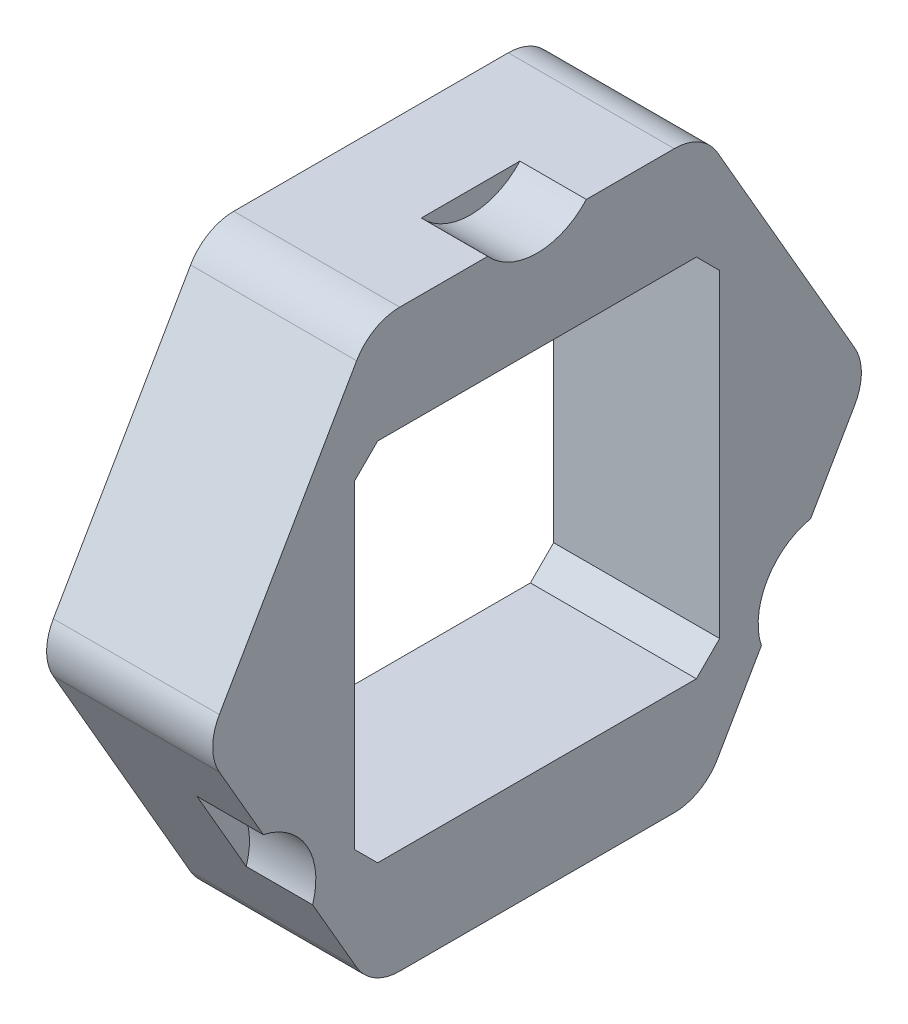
ISO-10303-21;
HEADER;
FILE_DESCRIPTION(('STEP AP214'),'2;1');
FILE_NAME('part.step','',(''),(''),'','','');
FILE_SCHEMA(('AUTOMOTIVE_DESIGN { 1 0 10303 214 1 1 1 1 }'));
ENDSEC;
DATA;
#1=APPLICATION_CONTEXT('core data for automotive mechanical design processes');
#2=APPLICATION_PROTOCOL_DEFINITION('international standard','automotive_design',2000,#1);
#3=PRODUCT_CONTEXT('',#1,'mechanical');
#4=PRODUCT('Part','Part','',(#3));
#5=PRODUCT_RELATED_PRODUCT_CATEGORY('part','',(#4));
#6=PRODUCT_DEFINITION_FORMATION('','',#4);
#7=PRODUCT_DEFINITION_CONTEXT('part definition',#1,'design');
#8=PRODUCT_DEFINITION('design','',#6,#7);
#9=PRODUCT_DEFINITION_SHAPE('','',#8);
#10=(LENGTH_UNIT() NAMED_UNIT(*) SI_UNIT(.MILLI.,.METRE.));
#11=(NAMED_UNIT(*) PLANE_ANGLE_UNIT() SI_UNIT($,.RADIAN.));
#12=(NAMED_UNIT(*) SI_UNIT($,.STERADIAN.) SOLID_ANGLE_UNIT());
#13=UNCERTAINTY_MEASURE_WITH_UNIT(LENGTH_MEASURE(1.E-05),#10,'distance_accuracy_value','');
#14=(GEOMETRIC_REPRESENTATION_CONTEXT(3) GLOBAL_UNCERTAINTY_ASSIGNED_CONTEXT((#13)) GLOBAL_UNIT_ASSIGNED_CONTEXT((#10,
#11,#12)) REPRESENTATION_CONTEXT('',''));
#15=CARTESIAN_POINT('',(0.,0.,0.));
#16=DIRECTION('',(0.,0.,1.));
#17=DIRECTION('',(1.,0.,0.));
#18=AXIS2_PLACEMENT_3D('',#15,#16,#17);
#19=CARTESIAN_POINT('',(12.7,-21.9970452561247,-52.4123750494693));
#20=DIRECTION('',(0.,1.,0.));
#21=DIRECTION('',(0.,0.,1.));
#22=AXIS2_PLACEMENT_3D('',#19,#20,#21);
#23=PLANE('',#22);
#24=DIRECTION('',(0.,0.,-1.));
#25=VECTOR('',#24,1.);
#26=CARTESIAN_POINT('',(12.7,-21.9970452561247,-52.4123750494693));
#27=LINE('',#26,#25);
#28=CARTESIAN_POINT('',(12.7,-21.9970452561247,10.5002954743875));
#29=VERTEX_POINT('',#28);
#30=CARTESIAN_POINT('',(12.7,-21.9970452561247,-10.5002954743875));
#31=VERTEX_POINT('',#30);
#32=EDGE_CURVE('E267',#29,#31,#27,.T.);
#33=ORIENTED_EDGE('',*,*,#32,.F.);
#34=DIRECTION('',(-1.,0.,0.));
#35=VECTOR('',#34,1.);
#36=CARTESIAN_POINT('',(12.7,-21.9970452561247,10.5002954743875));
#37=LINE('',#36,#35);
#38=CARTESIAN_POINT('',(0.,-21.9970452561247,10.5002954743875));
#39=VERTEX_POINT('',#38);
#40=EDGE_CURVE('E346',#29,#39,#37,.T.);
#41=ORIENTED_EDGE('',*,*,#40,.T.);
#42=DIRECTION('',(0.,0.,-1.));
#43=VECTOR('',#42,1.);
#44=CARTESIAN_POINT('',(0.,-21.9970452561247,-52.4123750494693));
#45=LINE('',#44,#43);
#46=CARTESIAN_POINT('',(0.,-21.9970452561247,-10.5002954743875));
#47=VERTEX_POINT('',#46);
#48=EDGE_CURVE('E309',#39,#47,#45,.T.);
#49=ORIENTED_EDGE('',*,*,#48,.T.);
#50=DIRECTION('',(-1.,0.,0.));
#51=VECTOR('',#50,1.);
#52=CARTESIAN_POINT('',(12.7,-21.9970452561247,-10.5002954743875));
#53=LINE('',#52,#51);
#54=EDGE_CURVE('E344',#47,#31,#53,.F.);
#55=ORIENTED_EDGE('',*,*,#54,.T.);
#56=EDGE_LOOP('',(#33,#41,#49,#55));
#57=FACE_BOUND('',#56,.T.);
#58=ADVANCED_FACE('F34',(#57),#23,.F.);
#59=CARTESIAN_POINT('',(12.7,11.6967015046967,-32.1530937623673));
#60=DIRECTION('',(0.,0.5,0.866025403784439));
#61=DIRECTION('',(0.,-0.866025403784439,0.5));
#62=AXIS2_PLACEMENT_3D('',#59,#60,#61);
#63=PLANE('',#62);
#64=DIRECTION('',(0.,0.866025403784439,-0.5));
#65=VECTOR('',#64,1.);
#66=CARTESIAN_POINT('',(7.62,11.6967015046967,-32.1530937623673));
#67=LINE('',#66,#65);
#68=CARTESIAN_POINT('',(7.62,-14.26497701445,-17.1641116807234));
#69=VERTEX_POINT('',#68);
#70=CARTESIAN_POINT('',(7.62,-7.73206824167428,-20.9358883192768));
#71=VERTEX_POINT('',#70);
#72=EDGE_CURVE('E11',#69,#71,#67,.T.);
#73=ORIENTED_EDGE('',*,*,#72,.F.);
#74=DIRECTION('',(1.,0.,0.));
#75=VECTOR('',#74,1.);
#76=CARTESIAN_POINT('',(7.62,-14.26497701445,-17.1641116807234));
#77=LINE('',#76,#75);
#78=CARTESIAN_POINT('',(12.7,-14.2649770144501,-17.1641116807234));
#79=VERTEX_POINT('',#78);
#80=EDGE_CURVE('E213',#69,#79,#77,.T.);
#81=ORIENTED_EDGE('',*,*,#80,.T.);
#82=DIRECTION('',(0.,0.866025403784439,-0.5));
#83=VECTOR('',#82,1.);
#84=CARTESIAN_POINT('',(12.7,11.6967015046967,-32.1530937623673));
#85=LINE('',#84,#83);
#86=CARTESIAN_POINT('',(12.7,-20.0920452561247,-13.7998522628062));
#87=VERTEX_POINT('',#86);
#88=EDGE_CURVE('E270',#87,#79,#85,.T.);
#89=ORIENTED_EDGE('',*,*,#88,.F.);
#90=DIRECTION('',(-1.,0.,0.));
#91=VECTOR('',#90,1.);
#92=CARTESIAN_POINT('',(12.7,-20.0920452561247,-13.7998522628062));
#93=LINE('',#92,#91);
#94=CARTESIAN_POINT('',(0.,-20.0920452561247,-13.7998522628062));
#95=VERTEX_POINT('',#94);
#96=EDGE_CURVE('E381',#87,#95,#93,.T.);
#97=ORIENTED_EDGE('',*,*,#96,.T.);
#98=DIRECTION('',(0.,0.866025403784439,-0.5));
#99=VECTOR('',#98,1.);
#100=CARTESIAN_POINT('',(0.,11.6967015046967,-32.1530937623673));
#101=LINE('',#100,#99);
#102=CARTESIAN_POINT('',(0.,-1.90499999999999,-24.3001477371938));
#103=VERTEX_POINT('',#102);
#104=EDGE_CURVE('E312',#95,#103,#101,.T.);
#105=ORIENTED_EDGE('',*,*,#104,.T.);
#106=DIRECTION('',(-1.,0.,0.));
#107=VECTOR('',#106,1.);
#108=CARTESIAN_POINT('',(12.7,-1.90499999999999,-24.3001477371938));
#109=LINE('',#108,#107);
#110=CARTESIAN_POINT('',(12.7,-1.90499999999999,-24.3001477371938));
#111=VERTEX_POINT('',#110);
#112=EDGE_CURVE('E379',#103,#111,#109,.F.);
#113=ORIENTED_EDGE('',*,*,#112,.T.);
#114=CARTESIAN_POINT('',(12.7,-7.73206824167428,-20.9358883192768));
#115=VERTEX_POINT('',#114);
#116=EDGE_CURVE('E219',#115,#111,#85,.T.);
#117=ORIENTED_EDGE('',*,*,#116,.F.);
#118=DIRECTION('',(1.,0.,0.));
#119=VECTOR('',#118,1.);
#120=CARTESIAN_POINT('',(7.62,-7.73206824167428,-20.9358883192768));
#121=LINE('',#120,#119);
#122=EDGE_CURVE('E49',#115,#71,#121,.F.);
#123=ORIENTED_EDGE('',*,*,#122,.T.);
#124=EDGE_LOOP('',(#73,#81,#89,#97,#105,#113,#117,#123));
#125=FACE_BOUND('',#124,.T.);
#126=ADVANCED_FACE('F217',(#125),#63,.F.);
#127=CARTESIAN_POINT('',(12.7,-11.6967015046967,-32.1530937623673));
#128=DIRECTION('',(0.,-0.5,0.866025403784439));
#129=DIRECTION('',(0.,-0.866025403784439,-0.5));
#130=AXIS2_PLACEMENT_3D('',#127,#128,#129);
#131=PLANE('',#130);
#132=DIRECTION('',(0.,0.866025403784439,0.5));
#133=VECTOR('',#132,1.);
#134=CARTESIAN_POINT('',(12.7,-11.6967015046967,-32.1530937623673));
#135=LINE('',#134,#133);
#136=CARTESIAN_POINT('',(12.7,1.90500000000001,-24.3001477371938));
#137=VERTEX_POINT('',#136);
#138=CARTESIAN_POINT('',(12.7,20.0920452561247,-13.7998522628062));
#139=VERTEX_POINT('',#138);
#140=EDGE_CURVE('E273',#137,#139,#135,.T.);
#141=ORIENTED_EDGE('',*,*,#140,.F.);
#142=DIRECTION('',(-1.,0.,0.));
#143=VECTOR('',#142,1.);
#144=CARTESIAN_POINT('',(12.7,1.90500000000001,-24.3001477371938));
#145=LINE('',#144,#143);
#146=CARTESIAN_POINT('',(0.,1.90500000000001,-24.3001477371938));
#147=VERTEX_POINT('',#146);
#148=EDGE_CURVE('E386',#137,#147,#145,.T.);
#149=ORIENTED_EDGE('',*,*,#148,.T.);
#150=DIRECTION('',(0.,0.866025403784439,0.5));
#151=VECTOR('',#150,1.);
#152=CARTESIAN_POINT('',(0.,-11.6967015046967,-32.1530937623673));
#153=LINE('',#152,#151);
#154=CARTESIAN_POINT('',(0.,20.0920452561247,-13.7998522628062));
#155=VERTEX_POINT('',#154);
#156=EDGE_CURVE('E315',#147,#155,#153,.T.);
#157=ORIENTED_EDGE('',*,*,#156,.T.);
#158=DIRECTION('',(-1.,0.,0.));
#159=VECTOR('',#158,1.);
#160=CARTESIAN_POINT('',(12.7,20.0920452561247,-13.7998522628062));
#161=LINE('',#160,#159);
#162=EDGE_CURVE('E384',#155,#139,#161,.F.);
#163=ORIENTED_EDGE('',*,*,#162,.T.);
#164=EDGE_LOOP('',(#141,#149,#157,#163));
#165=FACE_BOUND('',#164,.T.);
#166=ADVANCED_FACE('F446',(#165),#131,.F.);
#167=CARTESIAN_POINT('',(12.7,21.9970452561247,-52.4123750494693));
#168=DIRECTION('',(0.,-1.,0.));
#169=DIRECTION('',(0.,0.,-1.));
#170=AXIS2_PLACEMENT_3D('',#167,#168,#169);
#171=PLANE('',#170);
#172=DIRECTION('',(0.,0.,1.));
#173=VECTOR('',#172,1.);
#174=CARTESIAN_POINT('',(7.62,21.9970452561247,-52.4123750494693));
#175=LINE('',#174,#173);
#176=CARTESIAN_POINT('',(7.62,21.9970452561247,-3.77177663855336));
#177=VERTEX_POINT('',#176);
#178=CARTESIAN_POINT('',(7.62,21.9970452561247,3.77177663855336));
#179=VERTEX_POINT('',#178);
#180=EDGE_CURVE('E400',#177,#179,#175,.T.);
#181=ORIENTED_EDGE('',*,*,#180,.F.);
#182=DIRECTION('',(1.,0.,0.));
#183=VECTOR('',#182,1.);
#184=CARTESIAN_POINT('',(7.62,21.9970452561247,-3.77177663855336));
#185=LINE('',#184,#183);
#186=CARTESIAN_POINT('',(12.7,21.9970452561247,-3.77177663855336));
#187=VERTEX_POINT('',#186);
#188=EDGE_CURVE('E241',#177,#187,#185,.T.);
#189=ORIENTED_EDGE('',*,*,#188,.T.);
#190=DIRECTION('',(0.,0.,1.));
#191=VECTOR('',#190,1.);
#192=CARTESIAN_POINT('',(12.7,21.9970452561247,-52.4123750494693));
#193=LINE('',#192,#191);
#194=CARTESIAN_POINT('',(12.7,21.9970452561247,-10.5002954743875));
#195=VERTEX_POINT('',#194);
#196=EDGE_CURVE('E277',#195,#187,#193,.T.);
#197=ORIENTED_EDGE('',*,*,#196,.F.);
#198=DIRECTION('',(-1.,0.,0.));
#199=VECTOR('',#198,1.);
#200=CARTESIAN_POINT('',(12.7,21.9970452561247,-10.5002954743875));
#201=LINE('',#200,#199);
#202=CARTESIAN_POINT('',(0.,21.9970452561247,-10.5002954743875));
#203=VERTEX_POINT('',#202);
#204=EDGE_CURVE('E392',#195,#203,#201,.T.);
#205=ORIENTED_EDGE('',*,*,#204,.T.);
#206=DIRECTION('',(0.,0.,1.));
#207=VECTOR('',#206,1.);
#208=CARTESIAN_POINT('',(0.,21.9970452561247,-52.4123750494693));
#209=LINE('',#208,#207);
#210=CARTESIAN_POINT('',(0.,21.9970452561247,10.5002954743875));
#211=VERTEX_POINT('',#210);
#212=EDGE_CURVE('E318',#203,#211,#209,.T.);
#213=ORIENTED_EDGE('',*,*,#212,.T.);
#214=DIRECTION('',(-1.,0.,0.));
#215=VECTOR('',#214,1.);
#216=CARTESIAN_POINT('',(12.7,21.9970452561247,10.5002954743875));
#217=LINE('',#216,#215);
#218=CARTESIAN_POINT('',(12.7,21.9970452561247,10.5002954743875));
#219=VERTEX_POINT('',#218);
#220=EDGE_CURVE('E389',#211,#219,#217,.F.);
#221=ORIENTED_EDGE('',*,*,#220,.T.);
#222=CARTESIAN_POINT('',(12.7,21.9970452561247,3.77177663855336));
#223=VERTEX_POINT('',#222);
#224=EDGE_CURVE('E276',#223,#219,#193,.T.);
#225=ORIENTED_EDGE('',*,*,#224,.F.);
#226=DIRECTION('',(1.,0.,0.));
#227=VECTOR('',#226,1.);
#228=CARTESIAN_POINT('',(7.62,21.9970452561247,3.77177663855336));
#229=LINE('',#228,#227);
#230=EDGE_CURVE('E237',#223,#179,#229,.F.);
#231=ORIENTED_EDGE('',*,*,#230,.T.);
#232=EDGE_LOOP('',(#181,#189,#197,#205,#213,#221,#225,#231));
#233=FACE_BOUND('',#232,.T.);
#234=ADVANCED_FACE('F435',(#233),#171,.F.);
#235=CARTESIAN_POINT('',(12.7,33.6937467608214,5.94690623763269));
#236=DIRECTION('',(0.,-0.5,-0.866025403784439));
#237=DIRECTION('',(0.,0.866025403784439,-0.5));
#238=AXIS2_PLACEMENT_3D('',#235,#236,#237);
#239=PLANE('',#238);
#240=DIRECTION('',(0.,-0.866025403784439,0.5));
#241=VECTOR('',#240,1.);
#242=CARTESIAN_POINT('',(12.7,33.6937467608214,5.94690623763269));
#243=LINE('',#242,#241);
#244=CARTESIAN_POINT('',(12.7,20.0920452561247,13.7998522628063));
#245=VERTEX_POINT('',#244);
#246=CARTESIAN_POINT('',(12.7,1.905,24.3001477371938));
#247=VERTEX_POINT('',#246);
#248=EDGE_CURVE('E280',#245,#247,#243,.T.);
#249=ORIENTED_EDGE('',*,*,#248,.F.);
#250=DIRECTION('',(-1.,0.,0.));
#251=VECTOR('',#250,1.);
#252=CARTESIAN_POINT('',(12.7,20.0920452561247,13.7998522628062));
#253=LINE('',#252,#251);
#254=CARTESIAN_POINT('',(0.,20.0920452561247,13.7998522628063));
#255=VERTEX_POINT('',#254);
#256=EDGE_CURVE('E397',#245,#255,#253,.T.);
#257=ORIENTED_EDGE('',*,*,#256,.T.);
#258=DIRECTION('',(0.,-0.866025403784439,0.5));
#259=VECTOR('',#258,1.);
#260=CARTESIAN_POINT('',(0.,33.6937467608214,5.94690623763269));
#261=LINE('',#260,#259);
#262=CARTESIAN_POINT('',(0.,1.905,24.3001477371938));
#263=VERTEX_POINT('',#262);
#264=EDGE_CURVE('E321',#255,#263,#261,.T.);
#265=ORIENTED_EDGE('',*,*,#264,.T.);
#266=DIRECTION('',(-1.,0.,0.));
#267=VECTOR('',#266,1.);
#268=CARTESIAN_POINT('',(12.7,1.90500000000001,24.3001477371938));
#269=LINE('',#268,#267);
#270=EDGE_CURVE('E395',#263,#247,#269,.F.);
#271=ORIENTED_EDGE('',*,*,#270,.T.);
#272=EDGE_LOOP('',(#249,#257,#265,#271));
#273=FACE_BOUND('',#272,.T.);
#274=ADVANCED_FACE('F426',(#273),#239,.F.);
#275=CARTESIAN_POINT('',(12.7,39.2871875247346,-13.1251875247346));
#276=DIRECTION('',(0.,0.707106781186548,0.707106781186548));
#277=DIRECTION('',(0.,-0.707106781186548,0.707106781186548));
#278=AXIS2_PLACEMENT_3D('',#275,#276,#277);
#279=PLANE('',#278);
#280=DIRECTION('',(0.,0.707106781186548,-0.707106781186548));
#281=VECTOR('',#280,1.);
#282=CARTESIAN_POINT('',(0.,39.2871875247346,-13.1251875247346));
#283=LINE('',#282,#281);
#284=CARTESIAN_POINT('',(0.,12.192,13.97));
#285=VERTEX_POINT('',#284);
#286=CARTESIAN_POINT('',(0.,13.97,12.192));
#287=VERTEX_POINT('',#286);
#288=EDGE_CURVE('E244',#285,#287,#283,.T.);
#289=ORIENTED_EDGE('',*,*,#288,.T.);
#290=DIRECTION('',(-1.,0.,0.));
#291=VECTOR('',#290,1.);
#292=CARTESIAN_POINT('',(12.7,13.97,12.192));
#293=LINE('',#292,#291);
#294=CARTESIAN_POINT('',(12.7,13.97,12.192));
#295=VERTEX_POINT('',#294);
#296=EDGE_CURVE('E341',#295,#287,#293,.T.);
#297=ORIENTED_EDGE('',*,*,#296,.F.);
#298=DIRECTION('',(0.,0.707106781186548,-0.707106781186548));
#299=VECTOR('',#298,1.);
#300=CARTESIAN_POINT('',(12.7,39.2871875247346,-13.1251875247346));
#301=LINE('',#300,#299);
#302=CARTESIAN_POINT('',(12.7,12.192,13.97));
#303=VERTEX_POINT('',#302);
#304=EDGE_CURVE('E245',#303,#295,#301,.T.);
#305=ORIENTED_EDGE('',*,*,#304,.F.);
#306=DIRECTION('',(-1.,0.,0.));
#307=VECTOR('',#306,1.);
#308=CARTESIAN_POINT('',(12.7,12.192,13.97));
#309=LINE('',#308,#307);
#310=EDGE_CURVE('E287',#303,#285,#309,.T.);
#311=ORIENTED_EDGE('',*,*,#310,.T.);
#312=EDGE_LOOP('',(#289,#297,#305,#311));
#313=FACE_BOUND('',#312,.T.);
#314=ADVANCED_FACE('F507',(#313),#279,.F.);
#315=CARTESIAN_POINT('',(12.7,13.97,-52.4123750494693));
#316=DIRECTION('',(0.,1.,0.));
#317=DIRECTION('',(0.,0.,1.));
#318=AXIS2_PLACEMENT_3D('',#315,#316,#317);
#319=PLANE('',#318);
#320=DIRECTION('',(0.,0.,-1.));
#321=VECTOR('',#320,1.);
#322=CARTESIAN_POINT('',(0.,13.97,-52.4123750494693));
#323=LINE('',#322,#321);
#324=CARTESIAN_POINT('',(0.,13.97,-12.192));
#325=VERTEX_POINT('',#324);
#326=EDGE_CURVE('E290',#287,#325,#323,.T.);
#327=ORIENTED_EDGE('',*,*,#326,.T.);
#328=DIRECTION('',(-1.,0.,0.));
#329=VECTOR('',#328,1.);
#330=CARTESIAN_POINT('',(12.7,13.97,-12.192));
#331=LINE('',#330,#329);
#332=CARTESIAN_POINT('',(12.7,13.97,-12.192));
#333=VERTEX_POINT('',#332);
#334=EDGE_CURVE('E338',#333,#325,#331,.T.);
#335=ORIENTED_EDGE('',*,*,#334,.F.);
#336=DIRECTION('',(0.,0.,-1.));
#337=VECTOR('',#336,1.);
#338=CARTESIAN_POINT('',(12.7,13.97,-52.4123750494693));
#339=LINE('',#338,#337);
#340=EDGE_CURVE('E248',#295,#333,#339,.T.);
#341=ORIENTED_EDGE('',*,*,#340,.F.);
#342=ORIENTED_EDGE('',*,*,#296,.T.);
#343=EDGE_LOOP('',(#327,#335,#341,#342));
#344=FACE_BOUND('',#343,.T.);
#345=ADVANCED_FACE('F504',(#344),#319,.F.);
#346=CARTESIAN_POINT('',(12.7,-13.1251875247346,-39.2871875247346));
#347=DIRECTION('',(0.,0.707106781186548,-0.707106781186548));
#348=DIRECTION('',(0.,0.707106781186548,0.707106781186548));
#349=AXIS2_PLACEMENT_3D('',#346,#347,#348);
#350=PLANE('',#349);
#351=DIRECTION('',(0.,-0.707106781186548,-0.707106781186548));
#352=VECTOR('',#351,1.);
#353=CARTESIAN_POINT('',(0.,-13.1251875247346,-39.2871875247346));
#354=LINE('',#353,#352);
#355=CARTESIAN_POINT('',(0.,12.192,-13.97));
#356=VERTEX_POINT('',#355);
#357=EDGE_CURVE('E292',#325,#356,#354,.T.);
#358=ORIENTED_EDGE('',*,*,#357,.T.);
#359=DIRECTION('',(-1.,0.,0.));
#360=VECTOR('',#359,1.);
#361=CARTESIAN_POINT('',(12.7,12.192,-13.97));
#362=LINE('',#361,#360);
#363=CARTESIAN_POINT('',(12.7,12.192,-13.97));
#364=VERTEX_POINT('',#363);
#365=EDGE_CURVE('E335',#364,#356,#362,.T.);
#366=ORIENTED_EDGE('',*,*,#365,.F.);
#367=DIRECTION('',(0.,-0.707106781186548,-0.707106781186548));
#368=VECTOR('',#367,1.);
#369=CARTESIAN_POINT('',(12.7,-13.1251875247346,-39.2871875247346));
#370=LINE('',#369,#368);
#371=EDGE_CURVE('E251',#333,#364,#370,.T.);
#372=ORIENTED_EDGE('',*,*,#371,.F.);
#373=ORIENTED_EDGE('',*,*,#334,.T.);
#374=EDGE_LOOP('',(#358,#366,#372,#373));
#375=FACE_BOUND('',#374,.T.);
#376=ADVANCED_FACE('F500',(#375),#350,.F.);
#377=CARTESIAN_POINT('',(12.7,0.,-13.97));
#378=DIRECTION('',(0.,0.,-1.));
#379=DIRECTION('',(0.,1.,0.));
#380=AXIS2_PLACEMENT_3D('',#377,#378,#379);
#381=PLANE('',#380);
#382=DIRECTION('',(0.,-1.,0.));
#383=VECTOR('',#382,1.);
#384=CARTESIAN_POINT('',(0.,0.,-13.97));
#385=LINE('',#384,#383);
#386=CARTESIAN_POINT('',(0.,-12.192,-13.97));
#387=VERTEX_POINT('',#386);
#388=EDGE_CURVE('E294',#356,#387,#385,.T.);
#389=ORIENTED_EDGE('',*,*,#388,.T.);
#390=DIRECTION('',(-1.,0.,0.));
#391=VECTOR('',#390,1.);
#392=CARTESIAN_POINT('',(12.7,-12.192,-13.97));
#393=LINE('',#392,#391);
#394=CARTESIAN_POINT('',(12.7,-12.192,-13.97));
#395=VERTEX_POINT('',#394);
#396=EDGE_CURVE('E333',#395,#387,#393,.T.);
#397=ORIENTED_EDGE('',*,*,#396,.F.);
#398=DIRECTION('',(0.,-1.,0.));
#399=VECTOR('',#398,1.);
#400=CARTESIAN_POINT('',(12.7,0.,-13.97));
#401=LINE('',#400,#399);
#402=EDGE_CURVE('E253',#364,#395,#401,.T.);
#403=ORIENTED_EDGE('',*,*,#402,.F.);
#404=ORIENTED_EDGE('',*,*,#365,.T.);
#405=EDGE_LOOP('',(#389,#397,#403,#404));
#406=FACE_BOUND('',#405,.T.);
#407=ADVANCED_FACE('F496',(#406),#381,.F.);
#408=CARTESIAN_POINT('',(12.7,13.1251875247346,-39.2871875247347));
#409=DIRECTION('',(0.,0.707106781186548,0.707106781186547));
#410=DIRECTION('',(0.,-0.707106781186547,0.707106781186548));
#411=AXIS2_PLACEMENT_3D('',#408,#409,#410);
#412=PLANE('',#411);
#413=DIRECTION('',(0.,0.707106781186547,-0.707106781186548));
#414=VECTOR('',#413,1.);
#415=CARTESIAN_POINT('',(0.,13.1251875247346,-39.2871875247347));
#416=LINE('',#415,#414);
#417=CARTESIAN_POINT('',(0.,-13.97,-12.192));
#418=VERTEX_POINT('',#417);
#419=EDGE_CURVE('E297',#418,#387,#416,.T.);
#420=ORIENTED_EDGE('',*,*,#419,.F.);
#421=DIRECTION('',(-1.,0.,0.));
#422=VECTOR('',#421,1.);
#423=CARTESIAN_POINT('',(12.7,-13.97,-12.192));
#424=LINE('',#423,#422);
#425=CARTESIAN_POINT('',(12.7,-13.97,-12.192));
#426=VERTEX_POINT('',#425);
#427=EDGE_CURVE('E331',#426,#418,#424,.T.);
#428=ORIENTED_EDGE('',*,*,#427,.F.);
#429=DIRECTION('',(0.,0.707106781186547,-0.707106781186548));
#430=VECTOR('',#429,1.);
#431=CARTESIAN_POINT('',(12.7,13.1251875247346,-39.2871875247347));
#432=LINE('',#431,#430);
#433=EDGE_CURVE('E255',#426,#395,#432,.T.);
#434=ORIENTED_EDGE('',*,*,#433,.T.);
#435=ORIENTED_EDGE('',*,*,#396,.T.);
#436=EDGE_LOOP('',(#420,#428,#434,#435));
#437=FACE_BOUND('',#436,.T.);
#438=ADVANCED_FACE('F492',(#437),#412,.T.);
#439=CARTESIAN_POINT('',(12.7,-13.97,-52.4123750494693));
#440=DIRECTION('',(0.,1.,0.));
#441=DIRECTION('',(0.,0.,1.));
#442=AXIS2_PLACEMENT_3D('',#439,#440,#441);
#443=PLANE('',#442);
#444=DIRECTION('',(0.,0.,-1.));
#445=VECTOR('',#444,1.);
#446=CARTESIAN_POINT('',(0.,-13.97,-52.4123750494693));
#447=LINE('',#446,#445);
#448=CARTESIAN_POINT('',(0.,-13.97,12.192));
#449=VERTEX_POINT('',#448);
#450=EDGE_CURVE('E300',#449,#418,#447,.T.);
#451=ORIENTED_EDGE('',*,*,#450,.F.);
#452=DIRECTION('',(-1.,0.,0.));
#453=VECTOR('',#452,1.);
#454=CARTESIAN_POINT('',(12.7,-13.97,12.192));
#455=LINE('',#454,#453);
#456=CARTESIAN_POINT('',(12.7,-13.97,12.192));
#457=VERTEX_POINT('',#456);
#458=EDGE_CURVE('E329',#457,#449,#455,.T.);
#459=ORIENTED_EDGE('',*,*,#458,.F.);
#460=DIRECTION('',(0.,0.,-1.));
#461=VECTOR('',#460,1.);
#462=CARTESIAN_POINT('',(12.7,-13.97,-52.4123750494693));
#463=LINE('',#462,#461);
#464=EDGE_CURVE('E258',#457,#426,#463,.T.);
#465=ORIENTED_EDGE('',*,*,#464,.T.);
#466=ORIENTED_EDGE('',*,*,#427,.T.);
#467=EDGE_LOOP('',(#451,#459,#465,#466));
#468=FACE_BOUND('',#467,.T.);
#469=ADVANCED_FACE('F488',(#468),#443,.T.);
#470=CARTESIAN_POINT('',(12.7,-39.2871875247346,-13.1251875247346));
#471=DIRECTION('',(0.,0.707106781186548,-0.707106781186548));
#472=DIRECTION('',(0.,0.707106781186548,0.707106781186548));
#473=AXIS2_PLACEMENT_3D('',#470,#471,#472);
#474=PLANE('',#473);
#475=DIRECTION('',(0.,-0.707106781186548,-0.707106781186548));
#476=VECTOR('',#475,1.);
#477=CARTESIAN_POINT('',(0.,-39.2871875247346,-13.1251875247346));
#478=LINE('',#477,#476);
#479=CARTESIAN_POINT('',(0.,-12.192,13.97));
#480=VERTEX_POINT('',#479);
#481=EDGE_CURVE('E303',#480,#449,#478,.T.);
#482=ORIENTED_EDGE('',*,*,#481,.F.);
#483=DIRECTION('',(-1.,0.,0.));
#484=VECTOR('',#483,1.);
#485=CARTESIAN_POINT('',(12.7,-12.192,13.97));
#486=LINE('',#485,#484);
#487=CARTESIAN_POINT('',(12.7,-12.192,13.97));
#488=VERTEX_POINT('',#487);
#489=EDGE_CURVE('E327',#488,#480,#486,.T.);
#490=ORIENTED_EDGE('',*,*,#489,.F.);
#491=DIRECTION('',(0.,-0.707106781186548,-0.707106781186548));
#492=VECTOR('',#491,1.);
#493=CARTESIAN_POINT('',(12.7,-39.2871875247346,-13.1251875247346));
#494=LINE('',#493,#492);
#495=EDGE_CURVE('E261',#488,#457,#494,.T.);
#496=ORIENTED_EDGE('',*,*,#495,.T.);
#497=ORIENTED_EDGE('',*,*,#458,.T.);
#498=EDGE_LOOP('',(#482,#490,#496,#497));
#499=FACE_BOUND('',#498,.T.);
#500=ADVANCED_FACE('F484',(#499),#474,.T.);
#501=CARTESIAN_POINT('',(12.7,0.,13.97));
#502=DIRECTION('',(0.,0.,-1.));
#503=DIRECTION('',(0.,1.,0.));
#504=AXIS2_PLACEMENT_3D('',#501,#502,#503);
#505=PLANE('',#504);
#506=DIRECTION('',(0.,-1.,0.));
#507=VECTOR('',#506,1.);
#508=CARTESIAN_POINT('',(0.,0.,13.97));
#509=LINE('',#508,#507);
#510=EDGE_CURVE('E306',#285,#480,#509,.T.);
#511=ORIENTED_EDGE('',*,*,#510,.F.);
#512=ORIENTED_EDGE('',*,*,#310,.F.);
#513=DIRECTION('',(0.,-1.,0.));
#514=VECTOR('',#513,1.);
#515=CARTESIAN_POINT('',(12.7,0.,13.97));
#516=LINE('',#515,#514);
#517=EDGE_CURVE('E264',#303,#488,#516,.T.);
#518=ORIENTED_EDGE('',*,*,#517,.T.);
#519=ORIENTED_EDGE('',*,*,#489,.T.);
#520=EDGE_LOOP('',(#511,#512,#518,#519));
#521=FACE_BOUND('',#520,.T.);
#522=ADVANCED_FACE('F481',(#521),#505,.T.);
#523=CARTESIAN_POINT('',(12.7,-33.6937467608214,5.94690623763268));
#524=DIRECTION('',(0.,0.5,-0.866025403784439));
#525=DIRECTION('',(0.,0.866025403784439,0.5));
#526=AXIS2_PLACEMENT_3D('',#523,#524,#525);
#527=PLANE('',#526);
#528=DIRECTION('',(0.,-0.866025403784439,-0.5));
#529=VECTOR('',#528,1.);
#530=CARTESIAN_POINT('',(7.62,-33.6937467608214,5.94690623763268));
#531=LINE('',#530,#529);
#532=CARTESIAN_POINT('',(7.62,-7.73206824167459,20.9358883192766));
#533=VERTEX_POINT('',#532);
#534=CARTESIAN_POINT('',(7.62,-14.2649770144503,17.1641116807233));
#535=VERTEX_POINT('',#534);
#536=EDGE_CURVE('E42',#533,#535,#531,.T.);
#537=ORIENTED_EDGE('',*,*,#536,.F.);
#538=DIRECTION('',(1.,0.,0.));
#539=VECTOR('',#538,1.);
#540=CARTESIAN_POINT('',(7.62,-7.73206824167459,20.9358883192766));
#541=LINE('',#540,#539);
#542=CARTESIAN_POINT('',(12.7,-7.73206824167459,20.9358883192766));
#543=VERTEX_POINT('',#542);
#544=EDGE_CURVE('E230',#533,#543,#541,.T.);
#545=ORIENTED_EDGE('',*,*,#544,.T.);
#546=DIRECTION('',(0.,-0.866025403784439,-0.5));
#547=VECTOR('',#546,1.);
#548=CARTESIAN_POINT('',(12.7,-33.6937467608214,5.94690623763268));
#549=LINE('',#548,#547);
#550=CARTESIAN_POINT('',(12.7,-1.90499999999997,24.3001477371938));
#551=VERTEX_POINT('',#550);
#552=EDGE_CURVE('E284',#551,#543,#549,.T.);
#553=ORIENTED_EDGE('',*,*,#552,.F.);
#554=DIRECTION('',(-1.,0.,0.));
#555=VECTOR('',#554,1.);
#556=CARTESIAN_POINT('',(12.7,-1.90499999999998,24.3001477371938));
#557=LINE('',#556,#555);
#558=CARTESIAN_POINT('',(0.,-1.90499999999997,24.3001477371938));
#559=VERTEX_POINT('',#558);
#560=EDGE_CURVE('E361',#551,#559,#557,.T.);
#561=ORIENTED_EDGE('',*,*,#560,.T.);
#562=DIRECTION('',(0.,-0.866025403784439,-0.5));
#563=VECTOR('',#562,1.);
#564=CARTESIAN_POINT('',(0.,-33.6937467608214,5.94690623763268));
#565=LINE('',#564,#563);
#566=CARTESIAN_POINT('',(0.,-20.0920452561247,13.7998522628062));
#567=VERTEX_POINT('',#566);
#568=EDGE_CURVE('E249',#559,#567,#565,.T.);
#569=ORIENTED_EDGE('',*,*,#568,.T.);
#570=DIRECTION('',(-1.,0.,0.));
#571=VECTOR('',#570,1.);
#572=CARTESIAN_POINT('',(12.7,-20.0920452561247,13.7998522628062));
#573=LINE('',#572,#571);
#574=CARTESIAN_POINT('',(12.7,-20.0920452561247,13.7998522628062));
#575=VERTEX_POINT('',#574);
#576=EDGE_CURVE('E364',#567,#575,#573,.F.);
#577=ORIENTED_EDGE('',*,*,#576,.T.);
#578=CARTESIAN_POINT('',(12.7,-14.2649770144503,17.1641116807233));
#579=VERTEX_POINT('',#578);
#580=EDGE_CURVE('E283',#579,#575,#549,.T.);
#581=ORIENTED_EDGE('',*,*,#580,.F.);
#582=DIRECTION('',(1.,0.,0.));
#583=VECTOR('',#582,1.);
#584=CARTESIAN_POINT('',(7.62,-14.2649770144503,17.1641116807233));
#585=LINE('',#584,#583);
#586=EDGE_CURVE('E57',#579,#535,#585,.F.);
#587=ORIENTED_EDGE('',*,*,#586,.T.);
#588=EDGE_LOOP('',(#537,#545,#553,#561,#569,#577,#581,#587));
#589=FACE_BOUND('',#588,.T.);
#590=ADVANCED_FACE('F407',(#589),#527,.F.);
#591=CARTESIAN_POINT('',(12.7,0.,-52.4123750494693));
#592=DIRECTION('',(1.,0.,0.));
#593=DIRECTION('',(0.,0.,-1.));
#594=AXIS2_PLACEMENT_3D('',#591,#592,#593);
#595=PLANE('',#594);
#596=CARTESIAN_POINT('',(12.7,-12.6999999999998,-21.9970452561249));
#597=DIRECTION('',(1.,0.,0.));
#598=DIRECTION('',(0.,-0.866025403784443,0.499999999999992));
#599=AXIS2_PLACEMENT_3D('',#596,#597,#598);
#600=CIRCLE('',#599,5.08);
#601=EDGE_CURVE('E214',#115,#79,#600,.T.);
#602=ORIENTED_EDGE('',*,*,#601,.F.);
#603=ORIENTED_EDGE('',*,*,#116,.T.);
#604=CARTESIAN_POINT('',(12.7,0.,-21.000590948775));
#605=DIRECTION('',(1.,0.,0.));
#606=DIRECTION('',(0.,0.,-1.));
#607=AXIS2_PLACEMENT_3D('',#604,#605,#606);
#608=CIRCLE('',#607,3.81);
#609=EDGE_CURVE('E373',#111,#137,#608,.T.);
#610=ORIENTED_EDGE('',*,*,#609,.T.);
#611=ORIENTED_EDGE('',*,*,#140,.T.);
#612=CARTESIAN_POINT('',(12.7,18.1870452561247,-10.5002954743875));
#613=DIRECTION('',(1.,0.,0.));
#614=DIRECTION('',(0.,0.,-1.));
#615=AXIS2_PLACEMENT_3D('',#612,#613,#614);
#616=CIRCLE('',#615,3.81);
#617=EDGE_CURVE('E371',#139,#195,#616,.T.);
#618=ORIENTED_EDGE('',*,*,#617,.T.);
#619=ORIENTED_EDGE('',*,*,#196,.T.);
#620=CARTESIAN_POINT('',(12.7,25.4,0.));
#621=DIRECTION('',(1.,0.,0.));
#622=DIRECTION('',(0.,0.,-1.));
#623=AXIS2_PLACEMENT_3D('',#620,#621,#622);
#624=CIRCLE('',#623,5.08);
#625=EDGE_CURVE('E233',#223,#187,#624,.T.);
#626=ORIENTED_EDGE('',*,*,#625,.F.);
#627=ORIENTED_EDGE('',*,*,#224,.T.);
#628=CARTESIAN_POINT('',(12.7,18.1870452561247,10.5002954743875));
#629=DIRECTION('',(1.,0.,0.));
#630=DIRECTION('',(0.,0.,-1.));
#631=AXIS2_PLACEMENT_3D('',#628,#629,#630);
#632=CIRCLE('',#631,3.81);
#633=EDGE_CURVE('E369',#219,#245,#632,.T.);
#634=ORIENTED_EDGE('',*,*,#633,.T.);
#635=ORIENTED_EDGE('',*,*,#248,.T.);
#636=CARTESIAN_POINT('',(12.7,0.,21.0005909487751));
#637=DIRECTION('',(1.,0.,0.));
#638=DIRECTION('',(0.,0.,-1.));
#639=AXIS2_PLACEMENT_3D('',#636,#637,#638);
#640=CIRCLE('',#639,3.81);
#641=EDGE_CURVE('E367',#247,#551,#640,.T.);
#642=ORIENTED_EDGE('',*,*,#641,.T.);
#643=ORIENTED_EDGE('',*,*,#552,.T.);
#644=CARTESIAN_POINT('',(12.7,-12.7000000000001,21.9970452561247));
#645=DIRECTION('',(1.,0.,0.));
#646=DIRECTION('',(0.,0.866025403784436,0.500000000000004));
#647=AXIS2_PLACEMENT_3D('',#644,#645,#646);
#648=CIRCLE('',#647,5.08);
#649=EDGE_CURVE('E221',#579,#543,#648,.T.);
#650=ORIENTED_EDGE('',*,*,#649,.F.);
#651=ORIENTED_EDGE('',*,*,#580,.T.);
#652=CARTESIAN_POINT('',(12.7,-18.1870452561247,10.5002954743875));
#653=DIRECTION('',(1.,0.,0.));
#654=DIRECTION('',(0.,0.,-1.));
#655=AXIS2_PLACEMENT_3D('',#652,#653,#654);
#656=CIRCLE('',#655,3.81);
#657=EDGE_CURVE('E377',#575,#29,#656,.T.);
#658=ORIENTED_EDGE('',*,*,#657,.T.);
#659=ORIENTED_EDGE('',*,*,#32,.T.);
#660=CARTESIAN_POINT('',(12.7,-18.1870452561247,-10.5002954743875));
#661=DIRECTION('',(1.,0.,0.));
#662=DIRECTION('',(0.,0.,-1.));
#663=AXIS2_PLACEMENT_3D('',#660,#661,#662);
#664=CIRCLE('',#663,3.81);
#665=EDGE_CURVE('E375',#31,#87,#664,.T.);
#666=ORIENTED_EDGE('',*,*,#665,.T.);
#667=ORIENTED_EDGE('',*,*,#88,.T.);
#668=EDGE_LOOP('',(#602,#603,#610,#611,#618,#619,#626,#627,#634,#635,#642,#643,#650,#651,#658,
#659,#666,#667));
#669=FACE_BOUND('',#668,.T.);
#670=ORIENTED_EDGE('',*,*,#304,.T.);
#671=ORIENTED_EDGE('',*,*,#340,.T.);
#672=ORIENTED_EDGE('',*,*,#371,.T.);
#673=ORIENTED_EDGE('',*,*,#402,.T.);
#674=ORIENTED_EDGE('',*,*,#433,.F.);
#675=ORIENTED_EDGE('',*,*,#464,.F.);
#676=ORIENTED_EDGE('',*,*,#495,.F.);
#677=ORIENTED_EDGE('',*,*,#517,.F.);
#678=EDGE_LOOP('',(#670,#671,#672,#673,#674,#675,#676,#677));
#679=FACE_BOUND('',#678,.T.);
#680=ADVANCED_FACE('F411',(#669,#679),#595,.T.);
#681=CARTESIAN_POINT('',(0.,0.,-52.4123750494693));
#682=DIRECTION('',(1.,0.,0.));
#683=DIRECTION('',(0.,0.,-1.));
#684=AXIS2_PLACEMENT_3D('',#681,#682,#683);
#685=PLANE('',#684);
#686=ORIENTED_EDGE('',*,*,#288,.F.);
#687=ORIENTED_EDGE('',*,*,#510,.T.);
#688=ORIENTED_EDGE('',*,*,#481,.T.);
#689=ORIENTED_EDGE('',*,*,#450,.T.);
#690=ORIENTED_EDGE('',*,*,#419,.T.);
#691=ORIENTED_EDGE('',*,*,#388,.F.);
#692=ORIENTED_EDGE('',*,*,#357,.F.);
#693=ORIENTED_EDGE('',*,*,#326,.F.);
#694=EDGE_LOOP('',(#686,#687,#688,#689,#690,#691,#692,#693));
#695=FACE_BOUND('',#694,.T.);
#696=ORIENTED_EDGE('',*,*,#48,.F.);
#697=CARTESIAN_POINT('',(0.,-18.1870452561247,10.5002954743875));
#698=DIRECTION('',(1.,0.,0.));
#699=DIRECTION('',(0.,0.,-1.));
#700=AXIS2_PLACEMENT_3D('',#697,#698,#699);
#701=CIRCLE('',#700,3.81);
#702=EDGE_CURVE('E359',#39,#567,#701,.F.);
#703=ORIENTED_EDGE('',*,*,#702,.T.);
#704=ORIENTED_EDGE('',*,*,#568,.F.);
#705=CARTESIAN_POINT('',(0.,0.,21.0005909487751));
#706=DIRECTION('',(1.,0.,0.));
#707=DIRECTION('',(0.,0.,-1.));
#708=AXIS2_PLACEMENT_3D('',#705,#706,#707);
#709=CIRCLE('',#708,3.81);
#710=EDGE_CURVE('E349',#559,#263,#709,.F.);
#711=ORIENTED_EDGE('',*,*,#710,.T.);
#712=ORIENTED_EDGE('',*,*,#264,.F.);
#713=CARTESIAN_POINT('',(0.,18.1870452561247,10.5002954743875));
#714=DIRECTION('',(1.,0.,0.));
#715=DIRECTION('',(0.,0.,-1.));
#716=AXIS2_PLACEMENT_3D('',#713,#714,#715);
#717=CIRCLE('',#716,3.81);
#718=EDGE_CURVE('E351',#255,#211,#717,.F.);
#719=ORIENTED_EDGE('',*,*,#718,.T.);
#720=ORIENTED_EDGE('',*,*,#212,.F.);
#721=CARTESIAN_POINT('',(0.,18.1870452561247,-10.5002954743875));
#722=DIRECTION('',(1.,0.,0.));
#723=DIRECTION('',(0.,0.,-1.));
#724=AXIS2_PLACEMENT_3D('',#721,#722,#723);
#725=CIRCLE('',#724,3.81);
#726=EDGE_CURVE('E353',#203,#155,#725,.F.);
#727=ORIENTED_EDGE('',*,*,#726,.T.);
#728=ORIENTED_EDGE('',*,*,#156,.F.);
#729=CARTESIAN_POINT('',(0.,0.,-21.000590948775));
#730=DIRECTION('',(1.,0.,0.));
#731=DIRECTION('',(0.,0.,-1.));
#732=AXIS2_PLACEMENT_3D('',#729,#730,#731);
#733=CIRCLE('',#732,3.81);
#734=EDGE_CURVE('E355',#147,#103,#733,.F.);
#735=ORIENTED_EDGE('',*,*,#734,.T.);
#736=ORIENTED_EDGE('',*,*,#104,.F.);
#737=CARTESIAN_POINT('',(0.,-18.1870452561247,-10.5002954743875));
#738=DIRECTION('',(1.,0.,0.));
#739=DIRECTION('',(0.,0.,-1.));
#740=AXIS2_PLACEMENT_3D('',#737,#738,#739);
#741=CIRCLE('',#740,3.81);
#742=EDGE_CURVE('E357',#95,#47,#741,.F.);
#743=ORIENTED_EDGE('',*,*,#742,.T.);
#744=EDGE_LOOP('',(#696,#703,#704,#711,#712,#719,#720,#727,#728,#735,#736,#743));
#745=FACE_BOUND('',#744,.T.);
#746=ADVANCED_FACE('F423',(#695,#745),#685,.F.);
#747=CARTESIAN_POINT('',(12.7,-18.1870452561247,10.5002954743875));
#748=DIRECTION('',(-1.,0.,0.));
#749=DIRECTION('',(0.,0.,1.));
#750=AXIS2_PLACEMENT_3D('',#747,#748,#749);
#751=CYLINDRICAL_SURFACE('',#750,3.81);
#752=ORIENTED_EDGE('',*,*,#657,.F.);
#753=ORIENTED_EDGE('',*,*,#576,.F.);
#754=ORIENTED_EDGE('',*,*,#702,.F.);
#755=ORIENTED_EDGE('',*,*,#40,.F.);
#756=EDGE_LOOP('',(#752,#753,#754,#755));
#757=FACE_BOUND('',#756,.T.);
#758=ADVANCED_FACE('F462',(#757),#751,.T.);
#759=CARTESIAN_POINT('',(12.7,-18.1870452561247,-10.5002954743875));
#760=DIRECTION('',(-1.,0.,0.));
#761=DIRECTION('',(0.,0.,1.));
#762=AXIS2_PLACEMENT_3D('',#759,#760,#761);
#763=CYLINDRICAL_SURFACE('',#762,3.81);
#764=ORIENTED_EDGE('',*,*,#665,.F.);
#765=ORIENTED_EDGE('',*,*,#54,.F.);
#766=ORIENTED_EDGE('',*,*,#742,.F.);
#767=ORIENTED_EDGE('',*,*,#96,.F.);
#768=EDGE_LOOP('',(#764,#765,#766,#767));
#769=FACE_BOUND('',#768,.T.);
#770=ADVANCED_FACE('F457',(#769),#763,.T.);
#771=CARTESIAN_POINT('',(12.7,0.,-21.000590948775));
#772=DIRECTION('',(-1.,0.,0.));
#773=DIRECTION('',(0.,0.,1.));
#774=AXIS2_PLACEMENT_3D('',#771,#772,#773);
#775=CYLINDRICAL_SURFACE('',#774,3.81);
#776=ORIENTED_EDGE('',*,*,#609,.F.);
#777=ORIENTED_EDGE('',*,*,#112,.F.);
#778=ORIENTED_EDGE('',*,*,#734,.F.);
#779=ORIENTED_EDGE('',*,*,#148,.F.);
#780=EDGE_LOOP('',(#776,#777,#778,#779));
#781=FACE_BOUND('',#780,.T.);
#782=ADVANCED_FACE('F450',(#781),#775,.T.);
#783=CARTESIAN_POINT('',(12.7,18.1870452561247,-10.5002954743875));
#784=DIRECTION('',(-1.,0.,0.));
#785=DIRECTION('',(0.,0.,1.));
#786=AXIS2_PLACEMENT_3D('',#783,#784,#785);
#787=CYLINDRICAL_SURFACE('',#786,3.81);
#788=ORIENTED_EDGE('',*,*,#617,.F.);
#789=ORIENTED_EDGE('',*,*,#162,.F.);
#790=ORIENTED_EDGE('',*,*,#726,.F.);
#791=ORIENTED_EDGE('',*,*,#204,.F.);
#792=EDGE_LOOP('',(#788,#789,#790,#791));
#793=FACE_BOUND('',#792,.T.);
#794=ADVANCED_FACE('F441',(#793),#787,.T.);
#795=CARTESIAN_POINT('',(12.7,18.1870452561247,10.5002954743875));
#796=DIRECTION('',(-1.,0.,0.));
#797=DIRECTION('',(0.,0.,1.));
#798=AXIS2_PLACEMENT_3D('',#795,#796,#797);
#799=CYLINDRICAL_SURFACE('',#798,3.81);
#800=ORIENTED_EDGE('',*,*,#633,.F.);
#801=ORIENTED_EDGE('',*,*,#220,.F.);
#802=ORIENTED_EDGE('',*,*,#718,.F.);
#803=ORIENTED_EDGE('',*,*,#256,.F.);
#804=EDGE_LOOP('',(#800,#801,#802,#803));
#805=FACE_BOUND('',#804,.T.);
#806=ADVANCED_FACE('F430',(#805),#799,.T.);
#807=CARTESIAN_POINT('',(12.7,0.,21.0005909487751));
#808=DIRECTION('',(-1.,0.,0.));
#809=DIRECTION('',(0.,0.,1.));
#810=AXIS2_PLACEMENT_3D('',#807,#808,#809);
#811=CYLINDRICAL_SURFACE('',#810,3.81);
#812=ORIENTED_EDGE('',*,*,#641,.F.);
#813=ORIENTED_EDGE('',*,*,#270,.F.);
#814=ORIENTED_EDGE('',*,*,#710,.F.);
#815=ORIENTED_EDGE('',*,*,#560,.F.);
#816=EDGE_LOOP('',(#812,#813,#814,#815));
#817=FACE_BOUND('',#816,.T.);
#818=ADVANCED_FACE('F36',(#817),#811,.T.);
#819=CARTESIAN_POINT('',(7.62,25.4,0.));
#820=DIRECTION('',(1.,0.,0.));
#821=DIRECTION('',(0.,0.,-1.));
#822=AXIS2_PLACEMENT_3D('',#819,#820,#821);
#823=PLANE('',#822);
#824=ORIENTED_EDGE('',*,*,#180,.T.);
#825=CARTESIAN_POINT('',(7.62,25.4,0.));
#826=DIRECTION('',(1.,0.,0.));
#827=DIRECTION('',(0.,0.,-1.));
#828=AXIS2_PLACEMENT_3D('',#825,#826,#827);
#829=CIRCLE('',#828,5.08);
#830=EDGE_CURVE('E234',#179,#177,#829,.T.);
#831=ORIENTED_EDGE('',*,*,#830,.T.);
#832=EDGE_LOOP('',(#824,#831));
#833=FACE_BOUND('',#832,.T.);
#834=ADVANCED_FACE('F607',(#833),#823,.T.);
#835=CARTESIAN_POINT('',(7.62,25.4,0.));
#836=DIRECTION('',(1.,0.,0.));
#837=DIRECTION('',(0.,0.,-1.));
#838=AXIS2_PLACEMENT_3D('',#835,#836,#837);
#839=CYLINDRICAL_SURFACE('',#838,5.08);
#840=ORIENTED_EDGE('',*,*,#830,.F.);
#841=ORIENTED_EDGE('',*,*,#230,.F.);
#842=ORIENTED_EDGE('',*,*,#625,.T.);
#843=ORIENTED_EDGE('',*,*,#188,.F.);
#844=EDGE_LOOP('',(#840,#841,#842,#843));
#845=FACE_BOUND('',#844,.T.);
#846=ADVANCED_FACE('F540',(#845),#839,.F.);
#847=CARTESIAN_POINT('',(7.62,-12.7000000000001,21.9970452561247));
#848=DIRECTION('',(1.,0.,0.));
#849=DIRECTION('',(0.,0.866025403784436,0.500000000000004));
#850=AXIS2_PLACEMENT_3D('',#847,#848,#849);
#851=PLANE('',#850);
#852=ORIENTED_EDGE('',*,*,#536,.T.);
#853=CARTESIAN_POINT('',(7.62,-12.7000000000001,21.9970452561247));
#854=DIRECTION('',(1.,0.,0.));
#855=DIRECTION('',(0.,0.866025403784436,0.500000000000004));
#856=AXIS2_PLACEMENT_3D('',#853,#854,#855);
#857=CIRCLE('',#856,5.08);
#858=EDGE_CURVE('E225',#535,#533,#857,.T.);
#859=ORIENTED_EDGE('',*,*,#858,.T.);
#860=EDGE_LOOP('',(#852,#859));
#861=FACE_BOUND('',#860,.T.);
#862=ADVANCED_FACE('F403',(#861),#851,.T.);
#863=CARTESIAN_POINT('',(7.62,-12.7000000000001,21.9970452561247));
#864=DIRECTION('',(1.,0.,0.));
#865=DIRECTION('',(0.,0.,-1.));
#866=AXIS2_PLACEMENT_3D('',#863,#864,#865);
#867=CYLINDRICAL_SURFACE('',#866,5.08);
#868=ORIENTED_EDGE('',*,*,#858,.F.);
#869=ORIENTED_EDGE('',*,*,#586,.F.);
#870=ORIENTED_EDGE('',*,*,#649,.T.);
#871=ORIENTED_EDGE('',*,*,#544,.F.);
#872=EDGE_LOOP('',(#868,#869,#870,#871));
#873=FACE_BOUND('',#872,.T.);
#874=ADVANCED_FACE('F405',(#873),#867,.F.);
#875=CARTESIAN_POINT('',(7.62,-12.6999999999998,-21.9970452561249));
#876=DIRECTION('',(1.,0.,0.));
#877=DIRECTION('',(0.,-0.866025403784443,0.499999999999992));
#878=AXIS2_PLACEMENT_3D('',#875,#876,#877);
#879=PLANE('',#878);
#880=ORIENTED_EDGE('',*,*,#72,.T.);
#881=CARTESIAN_POINT('',(7.62,-12.6999999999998,-21.9970452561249));
#882=DIRECTION('',(1.,0.,0.));
#883=DIRECTION('',(0.,-0.866025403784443,0.499999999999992));
#884=AXIS2_PLACEMENT_3D('',#881,#882,#883);
#885=CIRCLE('',#884,5.08);
#886=EDGE_CURVE('E209',#71,#69,#885,.T.);
#887=ORIENTED_EDGE('',*,*,#886,.T.);
#888=EDGE_LOOP('',(#880,#887));
#889=FACE_BOUND('',#888,.T.);
#890=ADVANCED_FACE('F208',(#889),#879,.T.);
#891=CARTESIAN_POINT('',(7.62,-12.6999999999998,-21.9970452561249));
#892=DIRECTION('',(1.,0.,0.));
#893=DIRECTION('',(0.,0.,-1.));
#894=AXIS2_PLACEMENT_3D('',#891,#892,#893);
#895=CYLINDRICAL_SURFACE('',#894,5.08);
#896=ORIENTED_EDGE('',*,*,#886,.F.);
#897=ORIENTED_EDGE('',*,*,#122,.F.);
#898=ORIENTED_EDGE('',*,*,#601,.T.);
#899=ORIENTED_EDGE('',*,*,#80,.F.);
#900=EDGE_LOOP('',(#896,#897,#898,#899));
#901=FACE_BOUND('',#900,.T.);
#902=ADVANCED_FACE('F212',(#901),#895,.F.);
#903=CLOSED_SHELL('',(#58,#126,#166,#234,#274,#314,#345,#376,#407,#438,#469,#500,#522,#590,#680,
#746,#758,#770,#782,#794,#806,#818,#834,#846,#862,#874,#890,#902));
#904=MANIFOLD_SOLID_BREP('B2',#903);
#905=ADVANCED_BREP_SHAPE_REPRESENTATION('',(#18,#904),#14);
#906=SHAPE_DEFINITION_REPRESENTATION(#9,#905);
ENDSEC;
END-ISO-10303-21;
